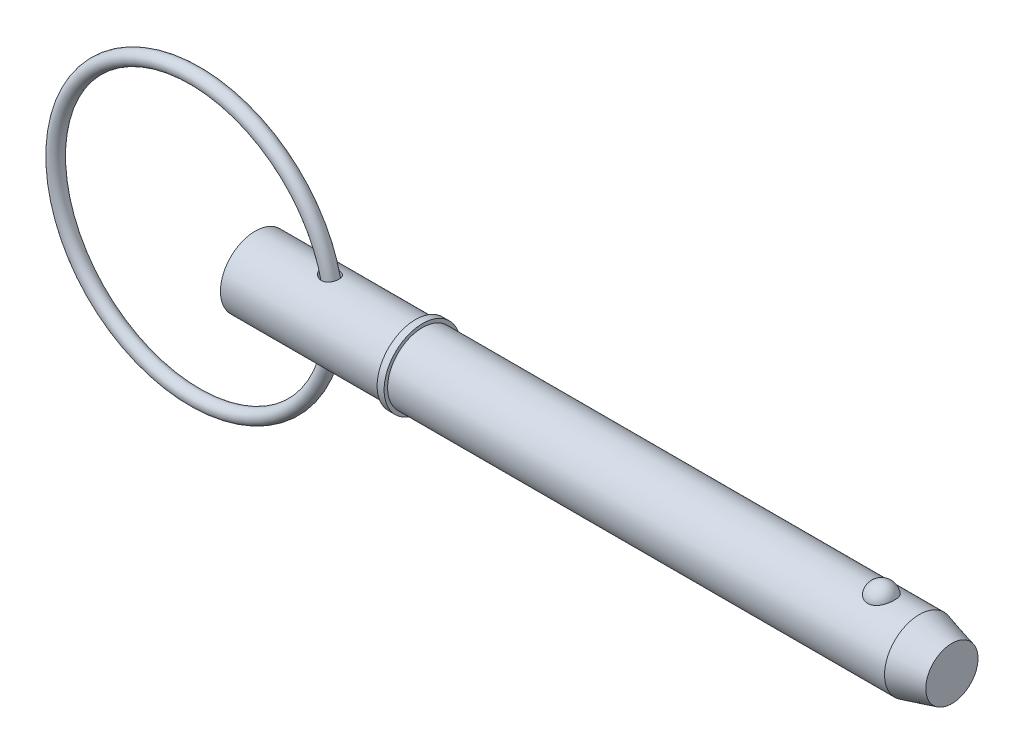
ISO-10303-21;
HEADER;
FILE_DESCRIPTION(('STEP AP214'),'2;1');
FILE_NAME('part.step','',(''),(''),'','','');
FILE_SCHEMA(('AUTOMOTIVE_DESIGN { 1 0 10303 214 1 1 1 1 }'));
ENDSEC;
DATA;
#1=APPLICATION_CONTEXT('core data for automotive mechanical design processes');
#2=APPLICATION_PROTOCOL_DEFINITION('international standard','automotive_design',2000,#1);
#3=PRODUCT_CONTEXT('',#1,'mechanical');
#4=PRODUCT('Part','Part','',(#3));
#5=PRODUCT_RELATED_PRODUCT_CATEGORY('part','',(#4));
#6=PRODUCT_DEFINITION_FORMATION('','',#4);
#7=PRODUCT_DEFINITION_CONTEXT('part definition',#1,'design');
#8=PRODUCT_DEFINITION('design','',#6,#7);
#9=PRODUCT_DEFINITION_SHAPE('','',#8);
#10=(LENGTH_UNIT() NAMED_UNIT(*) SI_UNIT(.MILLI.,.METRE.));
#11=(NAMED_UNIT(*) PLANE_ANGLE_UNIT() SI_UNIT($,.RADIAN.));
#12=(NAMED_UNIT(*) SI_UNIT($,.STERADIAN.) SOLID_ANGLE_UNIT());
#13=UNCERTAINTY_MEASURE_WITH_UNIT(LENGTH_MEASURE(1.E-05),#10,'distance_accuracy_value','');
#14=(GEOMETRIC_REPRESENTATION_CONTEXT(3) GLOBAL_UNCERTAINTY_ASSIGNED_CONTEXT((#13)) GLOBAL_UNIT_ASSIGNED_CONTEXT((#10,
#11,#12)) REPRESENTATION_CONTEXT('',''));
#15=CARTESIAN_POINT('',(0.,0.,0.));
#16=DIRECTION('',(0.,0.,1.));
#17=DIRECTION('',(1.,0.,0.));
#18=AXIS2_PLACEMENT_3D('',#15,#16,#17);
#19=CARTESIAN_POINT('',(-6.86864682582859,0.,0.));
#20=DIRECTION('',(0.,0.,1.));
#21=DIRECTION('',(1.,0.,0.));
#22=AXIS2_PLACEMENT_3D('',#19,#20,#21);
#23=TOROIDAL_SURFACE('',#22,15.875,0.794);
#24=CARTESIAN_POINT('',(9.80035317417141,0.,0.));
#25=VERTEX_POINT('',#24);
#26=VERTEX_LOOP('',#25);
#27=FACE_BOUND('',#26,.T.);
#28=ADVANCED_FACE('P0_F12',(#27),#23,.T.);
#29=CLOSED_SHELL('',(#28));
#30=MANIFOLD_SOLID_BREP('P0_B1',#29);
#31=CARTESIAN_POINT('',(0.,0.,0.));
#32=DIRECTION('',(1.,0.,0.));
#33=DIRECTION('',(0.,0.,-1.));
#34=AXIS2_PLACEMENT_3D('',#31,#32,#33);
#35=CYLINDRICAL_SURFACE('',#34,3.97);
#36=CARTESIAN_POINT('',(7.55504033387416,3.95240335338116,-0.373373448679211));
#37=CARTESIAN_POINT('',(7.57857626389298,3.94742764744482,-0.426034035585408));
#38=CARTESIAN_POINT('',(7.60690043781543,3.94158882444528,-0.476521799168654));
#39=CARTESIAN_POINT('',(7.67175252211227,3.92889627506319,-0.571840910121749));
#40=CARTESIAN_POINT('',(7.70829717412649,3.92204048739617,-0.616660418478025));
#41=CARTESIAN_POINT('',(7.7880127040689,3.90811378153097,-0.699502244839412));
#42=CARTESIAN_POINT('',(7.83115323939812,3.90104396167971,-0.737554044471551));
#43=CARTESIAN_POINT('',(7.92290500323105,3.88739302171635,-0.806417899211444));
#44=CARTESIAN_POINT('',(7.97151503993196,3.88081179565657,-0.837231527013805));
#45=CARTESIAN_POINT('',(8.07649084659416,3.86840671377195,-0.89285990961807));
#46=CARTESIAN_POINT('',(8.13315921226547,3.86266475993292,-0.917124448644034));
#47=CARTESIAN_POINT('',(8.249903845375,3.85323449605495,-0.95597423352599));
#48=CARTESIAN_POINT('',(8.30998046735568,3.84954640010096,-0.970558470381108));
#49=CARTESIAN_POINT('',(8.43159099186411,3.84477321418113,-0.989300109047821));
#50=CARTESIAN_POINT('',(8.49311729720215,3.84367671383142,-0.993503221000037));
#51=CARTESIAN_POINT('',(8.61594280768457,3.84429915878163,-0.991094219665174));
#52=CARTESIAN_POINT('',(8.67724211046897,3.84601670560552,-0.984487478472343));
#53=CARTESIAN_POINT('',(8.79355089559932,3.85191689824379,-0.961127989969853));
#54=CARTESIAN_POINT('',(8.84870898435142,3.85593011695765,-0.945070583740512));
#55=CARTESIAN_POINT('',(8.95525145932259,3.86583609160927,-0.903692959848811));
#56=CARTESIAN_POINT('',(9.00663668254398,3.87172842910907,-0.878374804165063));
#57=CARTESIAN_POINT('',(9.101933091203,3.88440641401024,-0.820440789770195));
#58=CARTESIAN_POINT('',(9.14607052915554,3.89114280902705,-0.788185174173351));
#59=CARTESIAN_POINT('',(9.22823149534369,3.90493885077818,-0.71671042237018));
#60=CARTESIAN_POINT('',(9.26625504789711,3.91199849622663,-0.677491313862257));
#61=CARTESIAN_POINT('',(9.33526828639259,3.92567450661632,-0.59313132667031));
#62=CARTESIAN_POINT('',(9.36624800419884,3.93229023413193,-0.547982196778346));
#63=CARTESIAN_POINT('',(9.42036305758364,3.94435299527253,-0.453062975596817));
#64=CARTESIAN_POINT('',(9.44349799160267,3.94979996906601,-0.403292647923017));
#65=CARTESIAN_POINT('',(9.48161154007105,3.95900091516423,-0.299892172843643));
#66=CARTESIAN_POINT('',(9.49648966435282,3.96273393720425,-0.246223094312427));
#67=CARTESIAN_POINT('',(9.51731386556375,3.96800895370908,-0.137074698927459));
#68=CARTESIAN_POINT('',(9.52325977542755,3.9695509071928,-0.0815953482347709));
#69=CARTESIAN_POINT('',(9.52608552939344,3.97028010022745,0.0297918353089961));
#70=CARTESIAN_POINT('',(9.52293563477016,3.96945961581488,0.0857004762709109));
#71=CARTESIAN_POINT('',(9.5075790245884,3.96553529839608,0.196178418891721));
#72=CARTESIAN_POINT('',(9.49537214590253,3.96243142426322,0.25074769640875));
#73=CARTESIAN_POINT('',(9.46218733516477,3.95427513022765,0.357000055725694));
#74=CARTESIAN_POINT('',(9.44120904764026,3.94922263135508,0.40868302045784));
#75=CARTESIAN_POINT('',(9.39097869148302,3.93771960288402,0.507691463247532));
#76=CARTESIAN_POINT('',(9.36172655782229,3.93126906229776,0.555016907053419));
#77=CARTESIAN_POINT('',(9.29572260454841,3.9176964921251,0.643874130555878));
#78=CARTESIAN_POINT('',(9.25898413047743,3.91057566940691,0.685416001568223));
#79=CARTESIAN_POINT('',(9.1789232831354,3.89645576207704,0.761601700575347));
#80=CARTESIAN_POINT('',(9.13560164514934,3.88945666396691,0.79624629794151));
#81=CARTESIAN_POINT('',(9.04406003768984,3.87645097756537,0.857319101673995));
#82=CARTESIAN_POINT('',(8.99589768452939,3.87043453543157,0.883831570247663));
#83=CARTESIAN_POINT('',(8.89567287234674,3.85997577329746,0.928447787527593));
#84=CARTESIAN_POINT('',(8.84361081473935,3.85553329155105,0.946552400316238));
#85=CARTESIAN_POINT('',(8.73746664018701,3.84871527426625,0.973904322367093));
#86=CARTESIAN_POINT('',(8.68340054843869,3.84632597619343,0.983210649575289));
#87=CARTESIAN_POINT('',(8.57443237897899,3.84376823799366,0.993162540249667));
#88=CARTESIAN_POINT('',(8.51953018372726,3.84360011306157,0.993806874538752));
#89=CARTESIAN_POINT('',(8.40868901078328,3.84546046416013,0.986583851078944));
#90=CARTESIAN_POINT('',(8.35276804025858,3.84755469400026,0.97846170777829));
#91=CARTESIAN_POINT('',(8.24293801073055,3.85374731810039,0.953777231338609));
#92=CARTESIAN_POINT('',(8.18902962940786,3.85784638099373,0.937212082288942));
#93=CARTESIAN_POINT('',(8.08103474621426,3.86789936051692,0.894850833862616));
#94=CARTESIAN_POINT('',(8.02716623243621,3.87395687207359,0.868522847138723));
#95=CARTESIAN_POINT('',(7.92444974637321,3.88711632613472,0.807586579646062));
#96=CARTESIAN_POINT('',(7.87560399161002,3.89421872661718,0.7729746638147));
#97=CARTESIAN_POINT('',(7.7825771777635,3.90895350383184,0.694712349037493));
#98=CARTESIAN_POINT('',(7.73864194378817,3.916595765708,0.650769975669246));
#99=CARTESIAN_POINT('',(7.65930793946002,3.93121788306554,0.555638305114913));
#100=CARTESIAN_POINT('',(7.62390591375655,3.93819799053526,0.504451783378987));
#101=CARTESIAN_POINT('',(7.56512704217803,3.95020492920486,0.399268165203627));
#102=CARTESIAN_POINT('',(7.54117152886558,3.95532161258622,0.345606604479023));
#103=CARTESIAN_POINT('',(7.5037545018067,3.96345177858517,0.234589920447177));
#104=CARTESIAN_POINT('',(7.49028363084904,3.96646713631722,0.177238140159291));
#105=CARTESIAN_POINT('',(7.4756155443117,3.96976030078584,0.0675802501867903));
#106=CARTESIAN_POINT('',(7.47319553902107,3.97031070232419,0.0154431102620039));
#107=CARTESIAN_POINT('',(7.47743162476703,3.96935406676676,-0.0884045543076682));
#108=CARTESIAN_POINT('',(7.48407724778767,3.96784940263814,-0.14011550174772));
#109=CARTESIAN_POINT('',(7.50184406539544,3.96390208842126,-0.222210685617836));
#110=CARTESIAN_POINT('',(7.51030342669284,3.96203347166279,-0.253229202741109));
#111=CARTESIAN_POINT('',(7.53036279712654,3.95766645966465,-0.314179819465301));
#112=CARTESIAN_POINT('',(7.5419623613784,3.9551681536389,-0.344112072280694));
#113=CARTESIAN_POINT('',(7.55504033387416,3.95240335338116,-0.373373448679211));
#114=B_SPLINE_CURVE_WITH_KNOTS('',3,(#36,#37,#38,#39,#40,#41,#42,#43,#44,#45,#46,#47,#48,#49,
#50,#51,#52,#53,#54,#55,#56,#57,#58,#59,#60,#61,#62,#63,#64,#65,#66,#67,#68,#69,#70,#71,#72,#73,
#74,#75,#76,#77,#78,#79,#80,#81,#82,#83,#84,#85,#86,#87,#88,#89,#90,#91,#92,#93,#94,#95,#96,#97,
#98,#99,#100,#101,#102,#103,#104,#105,#106,#107,#108,#109,#110,#111,#112,#113),.UNSPECIFIED.,
.T.,.F.,(4,2,2,2,2,2,2,2,2,2,2,2,2,2,2,2,2,2,2,2,2,2,2,2,2,2,2,2,2,2,2,2,2,2,2,2,2,2,4),(0.,
0.173554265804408,0.347465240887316,0.520599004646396,0.693695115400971,0.878558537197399,
1.0634412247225,1.24750837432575,1.43148407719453,1.60336872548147,1.77521512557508,
1.93967886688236,2.10414195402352,2.26883635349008,2.43353918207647,2.60020488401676,
2.76687370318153,2.93408806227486,3.10130543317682,3.26852958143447,3.43575504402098,
3.60268496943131,3.76959626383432,3.93471461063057,4.0998159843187,4.26380184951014,
4.42781098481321,4.5967184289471,4.76568224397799,4.94567321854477,5.12574332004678,
5.31261375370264,5.49941278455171,5.67537040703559,5.85117081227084,6.00695555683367,
6.16256057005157,6.25901137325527,6.35544851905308),.UNSPECIFIED.);
#115=CARTESIAN_POINT('',(7.55504033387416,3.95240335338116,-0.373373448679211));
#116=VERTEX_POINT('',#115);
#117=EDGE_CURVE('P1_E42',#116,#116,#114,.T.);
#118=ORIENTED_EDGE('',*,*,#117,.T.);
#119=EDGE_LOOP('',(#118));
#120=FACE_BOUND('',#119,.T.);
#121=CARTESIAN_POINT('',(0.,0.,0.));
#122=DIRECTION('',(1.,0.,0.));
#123=DIRECTION('',(0.,0.,-1.));
#124=AXIS2_PLACEMENT_3D('',#121,#122,#123);
#125=CIRCLE('',#124,3.97);
#126=CARTESIAN_POINT('',(0.,0.,-3.97));
#127=VERTEX_POINT('',#126);
#128=EDGE_CURVE('P1_E9',#127,#127,#125,.T.);
#129=ORIENTED_EDGE('',*,*,#128,.T.);
#130=EDGE_LOOP('',(#129));
#131=FACE_BOUND('',#130,.T.);
#132=CARTESIAN_POINT('',(18.256,0.,0.));
#133=DIRECTION('',(1.,0.,0.));
#134=DIRECTION('',(0.,0.,-1.));
#135=AXIS2_PLACEMENT_3D('',#132,#133,#134);
#136=CIRCLE('',#135,3.97);
#137=CARTESIAN_POINT('',(18.256,0.,-3.97));
#138=VERTEX_POINT('',#137);
#139=EDGE_CURVE('P1_E25',#138,#138,#136,.T.);
#140=ORIENTED_EDGE('',*,*,#139,.F.);
#141=EDGE_LOOP('',(#140));
#142=FACE_BOUND('',#141,.T.);
#143=CARTESIAN_POINT('',(7.55504033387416,-3.95240335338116,-0.373373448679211));
#144=CARTESIAN_POINT('',(7.53460920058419,-3.95672239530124,-0.327655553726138));
#145=CARTESIAN_POINT('',(7.51777420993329,-3.96039298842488,-0.280271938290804));
#146=CARTESIAN_POINT('',(7.49205527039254,-3.96606288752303,-0.183298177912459));
#147=CARTESIAN_POINT('',(7.48316724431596,-3.96806305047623,-0.133709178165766));
#148=CARTESIAN_POINT('',(7.47379315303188,-3.9701737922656,-0.0336103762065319));
#149=CARTESIAN_POINT('',(7.47332172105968,-3.97028108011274,0.0169008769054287));
#150=CARTESIAN_POINT('',(7.48084392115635,-3.96858544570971,0.11725681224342));
#151=CARTESIAN_POINT('',(7.48883849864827,-3.96678231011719,0.167101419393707));
#152=CARTESIAN_POINT('',(7.51265320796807,-3.96151492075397,0.263832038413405));
#153=CARTESIAN_POINT('',(7.52833209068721,-3.95808068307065,0.310754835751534));
#154=CARTESIAN_POINT('',(7.56673745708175,-3.94990960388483,0.401487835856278));
#155=CARTESIAN_POINT('',(7.58946563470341,-3.94517244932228,0.44529728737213));
#156=CARTESIAN_POINT('',(7.64284475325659,-3.93448395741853,0.53175081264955));
#157=CARTESIAN_POINT('',(7.67392233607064,-3.92847279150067,0.57412324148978));
#158=CARTESIAN_POINT('',(7.74208866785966,-3.91602761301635,0.653644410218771));
#159=CARTESIAN_POINT('',(7.77918016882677,-3.90959340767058,0.690790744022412));
#160=CARTESIAN_POINT('',(7.86273878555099,-3.89617013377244,0.763056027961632));
#161=CARTESIAN_POINT('',(7.90978795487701,-3.88919756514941,0.797506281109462));
#162=CARTESIAN_POINT('',(8.00882206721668,-3.87616232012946,0.858629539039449));
#163=CARTESIAN_POINT('',(8.06080923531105,-3.87010005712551,0.885299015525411));
#164=CARTESIAN_POINT('',(8.17187138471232,-3.85921766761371,0.931635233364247));
#165=CARTESIAN_POINT('',(8.23118658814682,-3.85449995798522,0.950754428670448));
#166=CARTESIAN_POINT('',(8.35233947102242,-3.84749758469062,0.97871022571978));
#167=CARTESIAN_POINT('',(8.41417663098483,-3.84521242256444,0.987548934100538));
#168=CARTESIAN_POINT('',(8.53665727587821,-3.84349493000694,0.994212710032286));
#169=CARTESIAN_POINT('',(8.59728174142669,-3.84397996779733,0.99235677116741));
#170=CARTESIAN_POINT('',(8.71718393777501,-3.84764343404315,0.978056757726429));
#171=CARTESIAN_POINT('',(8.77646227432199,-3.8508206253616,0.965617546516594));
#172=CARTESIAN_POINT('',(8.88778602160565,-3.85921632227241,0.931467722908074));
#173=CARTESIAN_POINT('',(8.94005016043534,-3.864284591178,0.91043061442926));
#174=CARTESIAN_POINT('',(9.04004360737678,-3.87587542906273,0.85974532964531));
#175=CARTESIAN_POINT('',(9.08777352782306,-3.88239780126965,0.830098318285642));
#176=CARTESIAN_POINT('',(9.17600506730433,-3.895934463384,0.763999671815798));
#177=CARTESIAN_POINT('',(9.21667512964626,-3.90292920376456,0.727768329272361));
#178=CARTESIAN_POINT('',(9.29136502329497,-3.91679963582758,0.648981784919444));
#179=CARTESIAN_POINT('',(9.32538470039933,-3.92367532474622,0.606426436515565));
#180=CARTESIAN_POINT('',(9.38618865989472,-3.9366168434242,0.515806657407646));
#181=CARTESIAN_POINT('',(9.4129117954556,-3.9426756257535,0.467700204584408));
#182=CARTESIAN_POINT('',(9.45812227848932,-3.95326415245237,0.367605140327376));
#183=CARTESIAN_POINT('',(9.47660924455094,-3.95779382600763,0.315616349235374));
#184=CARTESIAN_POINT('',(9.50505994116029,-3.96487773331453,0.208669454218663));
#185=CARTESIAN_POINT('',(9.51493710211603,-3.96741187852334,0.153686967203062));
#186=CARTESIAN_POINT('',(9.52562221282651,-3.97015680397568,0.0427905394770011));
#187=CARTESIAN_POINT('',(9.52643004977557,-3.97036755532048,-0.0131234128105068));
#188=CARTESIAN_POINT('',(9.51895215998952,-3.96844170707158,-0.124381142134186));
#189=CARTESIAN_POINT('',(9.51065320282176,-3.96630169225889,-0.179723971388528));
#190=CARTESIAN_POINT('',(9.48513477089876,-3.95989913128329,-0.288186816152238));
#191=CARTESIAN_POINT('',(9.46791509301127,-3.95563653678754,-0.341306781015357));
#192=CARTESIAN_POINT('',(9.42495956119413,-3.94545061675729,-0.443818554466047));
#193=CARTESIAN_POINT('',(9.39922309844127,-3.93952717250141,-0.493210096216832));
#194=CARTESIAN_POINT('',(9.33985370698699,-3.92667071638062,-0.586850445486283));
#195=CARTESIAN_POINT('',(9.30622091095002,-3.91973772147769,-0.631099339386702));
#196=CARTESIAN_POINT('',(9.23204774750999,-3.9056660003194,-0.713019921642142));
#197=CARTESIAN_POINT('',(9.19153441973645,-3.89852816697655,-0.750716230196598));
#198=CARTESIAN_POINT('',(9.10459278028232,-3.88483152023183,-0.818650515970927));
#199=CARTESIAN_POINT('',(9.05816529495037,-3.87827262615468,-0.848889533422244));
#200=CARTESIAN_POINT('',(8.96131655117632,-3.86655481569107,-0.900752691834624));
#201=CARTESIAN_POINT('',(8.91095192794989,-3.86137955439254,-0.922478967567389));
#202=CARTESIAN_POINT('',(8.8071927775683,-3.85288425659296,-0.957343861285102));
#203=CARTESIAN_POINT('',(8.75379837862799,-3.84956414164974,-0.97048284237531));
#204=CARTESIAN_POINT('',(8.64548182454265,-3.84510108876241,-0.988018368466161));
#205=CARTESIAN_POINT('',(8.59055875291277,-3.84395948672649,-0.992409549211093));
#206=CARTESIAN_POINT('',(8.48070473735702,-3.84391315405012,-0.992587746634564));
#207=CARTESIAN_POINT('',(8.42577379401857,-3.84500886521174,-0.988373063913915));
#208=CARTESIAN_POINT('',(8.31494327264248,-3.84934404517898,-0.971354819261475));
#209=CARTESIAN_POINT('',(8.25910274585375,-3.85267319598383,-0.958191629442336));
#210=CARTESIAN_POINT('',(8.15023512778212,-3.86114252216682,-0.923469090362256));
#211=CARTESIAN_POINT('',(8.09720922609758,-3.86628345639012,-0.901906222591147));
#212=CARTESIAN_POINT('',(7.9918189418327,-3.87819313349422,-0.849289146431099));
#213=CARTESIAN_POINT('',(7.93972943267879,-3.88504694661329,-0.817702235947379));
#214=CARTESIAN_POINT('',(7.84154327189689,-3.89937910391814,-0.746366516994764));
#215=CARTESIAN_POINT('',(7.79544783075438,-3.90685757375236,-0.706616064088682));
#216=CARTESIAN_POINT('',(7.71208259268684,-3.92134227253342,-0.621122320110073));
#217=CARTESIAN_POINT('',(7.67457985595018,-3.92835595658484,-0.57560820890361));
#218=CARTESIAN_POINT('',(7.60807883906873,-3.94134589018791,-0.478617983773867));
#219=CARTESIAN_POINT('',(7.57907194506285,-3.94732318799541,-0.427147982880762));
#220=CARTESIAN_POINT('',(7.55504033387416,-3.95240335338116,-0.373373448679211));
#221=B_SPLINE_CURVE_WITH_KNOTS('',3,(#143,#144,#145,#146,#147,#148,#149,#150,#151,#152,#153,
#154,#155,#156,#157,#158,#159,#160,#161,#162,#163,#164,#165,#166,#167,#168,#169,#170,#171,#172,
#173,#174,#175,#176,#177,#178,#179,#180,#181,#182,#183,#184,#185,#186,#187,#188,#189,#190,#191,
#192,#193,#194,#195,#196,#197,#198,#199,#200,#201,#202,#203,#204,#205,#206,#207,#208,#209,#210,
#211,#212,#213,#214,#215,#216,#217,#218,#219,#220),.UNSPECIFIED.,.T.,.F.,(4,2,2,2,2,2,2,2,2,2,2,
2,2,2,2,2,2,2,2,2,2,2,2,2,2,2,2,2,2,2,2,2,2,2,2,2,2,2,4),(0.,0.150601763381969,
0.301126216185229,0.451912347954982,0.602715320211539,0.750844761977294,0.899009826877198,
1.05703657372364,1.21513583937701,1.39056726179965,1.56607811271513,1.75265499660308,
1.93919364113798,2.12019769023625,2.30111860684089,2.46997605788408,2.63881067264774,
2.80278822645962,2.96676958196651,3.13208567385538,3.29740942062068,3.46437689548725,
3.63134644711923,3.79855889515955,3.96577515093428,4.13300336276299,4.30022876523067,
4.46681158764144,4.63337115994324,4.79786624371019,4.96235437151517,5.12694333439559,
5.29156480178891,5.46322695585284,5.63496109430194,5.81803489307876,6.00114560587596,
6.1784675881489,6.35560915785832),.UNSPECIFIED.);
#222=CARTESIAN_POINT('',(7.55504033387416,-3.95240335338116,-0.373373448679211));
#223=VERTEX_POINT('',#222);
#224=EDGE_CURVE('P1_E17',#223,#223,#221,.T.);
#225=ORIENTED_EDGE('',*,*,#224,.T.);
#226=EDGE_LOOP('',(#225));
#227=FACE_BOUND('',#226,.T.);
#228=ADVANCED_FACE('P1_F13',(#120,#131,#142,#227),#35,.T.);
#229=CARTESIAN_POINT('',(0.,0.,0.));
#230=DIRECTION('',(1.,0.,0.));
#231=DIRECTION('',(0.,0.,-1.));
#232=AXIS2_PLACEMENT_3D('',#229,#230,#231);
#233=CYLINDRICAL_SURFACE('',#232,3.97);
#234=CARTESIAN_POINT('',(75.6759395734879,0.,0.));
#235=DIRECTION('',(1.,0.,0.));
#236=DIRECTION('',(0.,0.,-1.));
#237=AXIS2_PLACEMENT_3D('',#234,#235,#236);
#238=CIRCLE('',#237,3.97);
#239=CARTESIAN_POINT('',(75.6759395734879,0.,-3.97));
#240=VERTEX_POINT('',#239);
#241=EDGE_CURVE('P1_E99',#240,#240,#238,.T.);
#242=ORIENTED_EDGE('',*,*,#241,.F.);
#243=EDGE_LOOP('',(#242));
#244=FACE_BOUND('',#243,.T.);
#245=CARTESIAN_POINT('',(19.05,0.,0.));
#246=DIRECTION('',(1.,0.,0.));
#247=DIRECTION('',(0.,0.,-1.));
#248=AXIS2_PLACEMENT_3D('',#245,#246,#247);
#249=CIRCLE('',#248,3.97);
#250=CARTESIAN_POINT('',(19.05,0.,-3.97));
#251=VERTEX_POINT('',#250);
#252=EDGE_CURVE('P1_E96',#251,#251,#249,.T.);
#253=ORIENTED_EDGE('',*,*,#252,.T.);
#254=EDGE_LOOP('',(#253));
#255=FACE_BOUND('',#254,.T.);
#256=CARTESIAN_POINT('',(71.3451922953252,3.65715365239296,1.54470941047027));
#257=CARTESIAN_POINT('',(71.2652448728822,3.65716001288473,1.54470290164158));
#258=CARTESIAN_POINT('',(71.1851650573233,3.65987074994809,1.53832549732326));
#259=CARTESIAN_POINT('',(71.0272374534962,3.67042218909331,1.5129701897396));
#260=CARTESIAN_POINT('',(70.9493961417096,3.67827646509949,1.49395894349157));
#261=CARTESIAN_POINT('',(70.7984614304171,3.69818848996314,1.44395950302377));
#262=CARTESIAN_POINT('',(70.7253560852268,3.71023513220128,1.41300293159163));
#263=CARTESIAN_POINT('',(70.5855630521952,3.73721833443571,1.34000212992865));
#264=CARTESIAN_POINT('',(70.5188725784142,3.75215363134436,1.2979627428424));
#265=CARTESIAN_POINT('',(70.3914886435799,3.78384968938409,1.20248834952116));
#266=CARTESIAN_POINT('',(70.3310299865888,3.80065129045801,1.14875388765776));
#267=CARTESIAN_POINT('',(70.2196942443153,3.83398532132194,1.03205417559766));
#268=CARTESIAN_POINT('',(70.1688200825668,3.85051766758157,0.969086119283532));
#269=CARTESIAN_POINT('',(70.0756321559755,3.88238608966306,0.832526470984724));
#270=CARTESIAN_POINT('',(70.0337961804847,3.89763698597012,0.758588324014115));
#271=CARTESIAN_POINT('',(69.9625108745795,3.92451063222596,0.604352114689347));
#272=CARTESIAN_POINT('',(69.9330623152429,3.93613315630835,0.524053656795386));
#273=CARTESIAN_POINT('',(69.8868927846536,3.95467606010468,0.358403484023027));
#274=CARTESIAN_POINT('',(69.8703127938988,3.96154426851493,0.273006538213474));
#275=CARTESIAN_POINT('',(69.850756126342,3.96967008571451,0.100408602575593));
#276=CARTESIAN_POINT('',(69.8477789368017,3.97092790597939,0.0132076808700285));
#277=CARTESIAN_POINT('',(69.8554587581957,3.96771794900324,-0.159844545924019));
#278=CARTESIAN_POINT('',(69.8660164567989,3.96329187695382,-0.245701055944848));
#279=CARTESIAN_POINT('',(69.9003800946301,3.94923163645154,-0.414277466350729));
#280=CARTESIAN_POINT('',(69.9241862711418,3.9395973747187,-0.496997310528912));
#281=CARTESIAN_POINT('',(69.9846114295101,3.91607752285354,-0.657113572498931));
#282=CARTESIAN_POINT('',(70.0212495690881,3.90218558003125,-0.734501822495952));
#283=CARTESIAN_POINT('',(70.1065935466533,3.87158287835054,-0.881704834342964));
#284=CARTESIAN_POINT('',(70.1553004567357,3.8548718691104,-0.951518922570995));
#285=CARTESIAN_POINT('',(70.2641161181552,3.82028735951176,-1.08208159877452));
#286=CARTESIAN_POINT('',(70.3242955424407,3.80240713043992,-1.14276958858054));
#287=CARTESIAN_POINT('',(70.454493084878,3.76758161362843,-1.25282437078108));
#288=CARTESIAN_POINT('',(70.5245105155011,3.75063626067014,-1.30219195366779));
#289=CARTESIAN_POINT('',(70.67118160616,3.71998948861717,-1.38729709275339));
#290=CARTESIAN_POINT('',(70.7476813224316,3.70623183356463,-1.42327904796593));
#291=CARTESIAN_POINT('',(70.9062981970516,3.68323188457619,-1.48178996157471));
#292=CARTESIAN_POINT('',(70.9884132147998,3.67398788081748,-1.50432401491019));
#293=CARTESIAN_POINT('',(71.151481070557,3.66152163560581,-1.53440939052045));
#294=CARTESIAN_POINT('',(71.2322840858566,3.65801951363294,-1.54265826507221));
#295=CARTESIAN_POINT('',(71.3942085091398,3.65657341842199,-1.54608423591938));
#296=CARTESIAN_POINT('',(71.4753298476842,3.65862829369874,-1.54126404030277));
#297=CARTESIAN_POINT('',(71.6328122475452,3.66788969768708,-1.51908474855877));
#298=CARTESIAN_POINT('',(71.7092422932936,3.67492621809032,-1.50213925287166));
#299=CARTESIAN_POINT('',(71.8580412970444,3.6931840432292,-1.45666982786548));
#300=CARTESIAN_POINT('',(71.9304099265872,3.70440568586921,-1.42814496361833));
#301=CARTESIAN_POINT('',(72.0708029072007,3.73012749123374,-1.35956319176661));
#302=CARTESIAN_POINT('',(72.1387000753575,3.74469307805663,-1.31927107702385));
#303=CARTESIAN_POINT('',(72.2668649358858,3.77545272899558,-1.22847440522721));
#304=CARTESIAN_POINT('',(72.3271308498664,3.79164717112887,-1.17796747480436));
#305=CARTESIAN_POINT('',(72.4416346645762,3.82490325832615,-1.06519260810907));
#306=CARTESIAN_POINT('',(72.4954137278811,3.84196735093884,-1.00245914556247));
#307=CARTESIAN_POINT('',(72.5920988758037,3.87439863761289,-0.868715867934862));
#308=CARTESIAN_POINT('',(72.6350030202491,3.88976552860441,-0.797704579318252));
#309=CARTESIAN_POINT('',(72.710266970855,3.91771381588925,-0.646896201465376));
#310=CARTESIAN_POINT('',(72.7422532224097,3.93019255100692,-0.566893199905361));
#311=CARTESIAN_POINT('',(72.7931101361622,3.95043886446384,-0.402255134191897));
#312=CARTESIAN_POINT('',(72.811980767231,3.95820643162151,-0.31762005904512));
#313=CARTESIAN_POINT('',(72.8362162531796,3.96823733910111,-0.146156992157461));
#314=CARTESIAN_POINT('',(72.8415874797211,3.970503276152,-0.0593300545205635));
#315=CARTESIAN_POINT('',(72.8387309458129,3.96930811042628,0.11405797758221));
#316=CARTESIAN_POINT('',(72.830503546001,3.9658471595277,0.200619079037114));
#317=CARTESIAN_POINT('',(72.8007063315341,3.95358562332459,0.370506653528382));
#318=CARTESIAN_POINT('',(72.7792129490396,3.94481563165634,0.453848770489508));
#319=CARTESIAN_POINT('',(72.7233839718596,3.92284586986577,0.615497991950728));
#320=CARTESIAN_POINT('',(72.6890474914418,3.90964579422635,0.693804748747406));
#321=CARTESIAN_POINT('',(72.6079702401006,3.88006987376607,0.843703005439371));
#322=CARTESIAN_POINT('',(72.5611536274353,3.86367478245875,0.915249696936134));
#323=CARTESIAN_POINT('',(72.4561897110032,3.82949741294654,1.0491081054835));
#324=CARTESIAN_POINT('',(72.3980428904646,3.81171519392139,1.11142021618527));
#325=CARTESIAN_POINT('',(72.2717433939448,3.77673366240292,1.22503948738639));
#326=CARTESIAN_POINT('',(72.2035970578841,3.75953398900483,1.27635357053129));
#327=CARTESIAN_POINT('',(72.0589009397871,3.7277050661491,1.36653336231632));
#328=CARTESIAN_POINT('',(71.9823480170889,3.71307678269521,1.40539439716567));
#329=CARTESIAN_POINT('',(71.8257594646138,3.68864287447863,1.46830480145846));
#330=CARTESIAN_POINT('',(71.7459307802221,3.67869017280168,1.4928128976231));
#331=CARTESIAN_POINT('',(71.5829877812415,3.66414535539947,1.52817474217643));
#332=CARTESIAN_POINT('',(71.4998840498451,3.65953723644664,1.5390692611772));
#333=CARTESIAN_POINT('',(71.3927760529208,3.65738948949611,1.54414878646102));
#334=CARTESIAN_POINT('',(71.3689900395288,3.65715175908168,1.54471134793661));
#335=CARTESIAN_POINT('',(71.3451922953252,3.65715365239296,1.54470941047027));
#336=B_SPLINE_CURVE_WITH_KNOTS('',3,(#256,#257,#258,#259,#260,#261,#262,#263,#264,#265,#266,
#267,#268,#269,#270,#271,#272,#273,#274,#275,#276,#277,#278,#279,#280,#281,#282,#283,#284,#285,
#286,#287,#288,#289,#290,#291,#292,#293,#294,#295,#296,#297,#298,#299,#300,#301,#302,#303,#304,
#305,#306,#307,#308,#309,#310,#311,#312,#313,#314,#315,#316,#317,#318,#319,#320,#321,#322,#323,
#324,#325,#326,#327,#328,#329,#330,#331,#332,#333,#334,#335),.UNSPECIFIED.,.T.,.F.,(4,2,2,2,2,2,
2,2,2,2,2,2,2,2,2,2,2,2,2,2,2,2,2,2,2,2,2,2,2,2,2,2,2,2,2,2,2,2,2,4),(0.,0.239777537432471,
0.480190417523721,0.719971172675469,0.959647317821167,1.2063904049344,1.45320863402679,
1.71093679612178,1.96868099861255,2.22921052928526,2.48973023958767,2.7483492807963,
3.00697295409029,3.26598440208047,3.52501886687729,3.78570385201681,4.04637062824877,
4.30201257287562,4.55755760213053,4.80022994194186,5.04285200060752,5.27757006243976,
5.51230707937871,5.75210128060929,5.99195126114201,6.24392810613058,6.49594987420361,
6.75588818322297,7.01582710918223,7.27564332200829,7.53545264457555,7.7937788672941,
8.05212290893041,8.31207418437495,8.57201437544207,8.83179046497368,9.09166393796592,
9.34270057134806,9.59298357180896,9.66435753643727),.UNSPECIFIED.);
#337=CARTESIAN_POINT('',(71.3451922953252,3.65715365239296,1.54470941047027));
#338=VERTEX_POINT('',#337);
#339=EDGE_CURVE('P1_E34',#338,#338,#336,.T.);
#340=ORIENTED_EDGE('',*,*,#339,.T.);
#341=EDGE_LOOP('',(#340));
#342=FACE_BOUND('',#341,.T.);
#343=ADVANCED_FACE('P1_F46',(#244,#255,#342),#233,.T.);
#344=CARTESIAN_POINT('',(0.,0.,0.));
#345=DIRECTION('',(-1.,0.,0.));
#346=DIRECTION('',(0.,0.,1.));
#347=AXIS2_PLACEMENT_3D('',#344,#345,#346);
#348=PLANE('',#347);
#349=ORIENTED_EDGE('',*,*,#128,.F.);
#350=EDGE_LOOP('',(#349));
#351=FACE_BOUND('',#350,.T.);
#352=ADVANCED_FACE('P1_F15',(#351),#348,.T.);
#353=CARTESIAN_POINT('',(18.256,3.97,0.));
#354=DIRECTION('',(-1.,0.,0.));
#355=DIRECTION('',(0.,0.,1.));
#356=AXIS2_PLACEMENT_3D('',#353,#354,#355);
#357=PLANE('',#356);
#358=ORIENTED_EDGE('',*,*,#139,.T.);
#359=EDGE_LOOP('',(#358));
#360=FACE_BOUND('',#359,.T.);
#361=CARTESIAN_POINT('',(18.256,0.,0.));
#362=DIRECTION('',(1.,0.,0.));
#363=DIRECTION('',(0.,0.,-1.));
#364=AXIS2_PLACEMENT_3D('',#361,#362,#363);
#365=CIRCLE('',#364,4.367);
#366=CARTESIAN_POINT('',(18.256,0.,-4.367));
#367=VERTEX_POINT('',#366);
#368=EDGE_CURVE('P1_E30',#367,#367,#365,.T.);
#369=ORIENTED_EDGE('',*,*,#368,.F.);
#370=EDGE_LOOP('',(#369));
#371=FACE_BOUND('',#370,.T.);
#372=ADVANCED_FACE('P1_F81',(#360,#371),#357,.T.);
#373=CARTESIAN_POINT('',(0.,0.,0.));
#374=DIRECTION('',(1.,0.,0.));
#375=DIRECTION('',(0.,0.,-1.));
#376=AXIS2_PLACEMENT_3D('',#373,#374,#375);
#377=CYLINDRICAL_SURFACE('',#376,4.367);
#378=ORIENTED_EDGE('',*,*,#368,.T.);
#379=EDGE_LOOP('',(#378));
#380=FACE_BOUND('',#379,.T.);
#381=CARTESIAN_POINT('',(19.05,0.,0.));
#382=DIRECTION('',(1.,0.,0.));
#383=DIRECTION('',(0.,0.,-1.));
#384=AXIS2_PLACEMENT_3D('',#381,#382,#383);
#385=CIRCLE('',#384,4.367);
#386=CARTESIAN_POINT('',(19.05,0.,-4.367));
#387=VERTEX_POINT('',#386);
#388=EDGE_CURVE('P1_E95',#387,#387,#385,.T.);
#389=ORIENTED_EDGE('',*,*,#388,.F.);
#390=EDGE_LOOP('',(#389));
#391=FACE_BOUND('',#390,.T.);
#392=ADVANCED_FACE('P1_F68',(#380,#391),#377,.T.);
#393=CARTESIAN_POINT('',(19.05,4.367,0.));
#394=DIRECTION('',(1.,0.,0.));
#395=DIRECTION('',(0.,0.,-1.));
#396=AXIS2_PLACEMENT_3D('',#393,#394,#395);
#397=PLANE('',#396);
#398=ORIENTED_EDGE('',*,*,#388,.T.);
#399=EDGE_LOOP('',(#398));
#400=FACE_BOUND('',#399,.T.);
#401=ORIENTED_EDGE('',*,*,#252,.F.);
#402=EDGE_LOOP('',(#401));
#403=FACE_BOUND('',#402,.T.);
#404=ADVANCED_FACE('P1_F62',(#400,#403),#397,.T.);
#405=CARTESIAN_POINT('',(79.38,0.,0.));
#406=DIRECTION('',(-1.,0.,0.));
#407=DIRECTION('',(0.,0.,1.));
#408=AXIS2_PLACEMENT_3D('',#405,#406,#407);
#409=CONICAL_SURFACE('',#408,2.97750000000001,0.26179938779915);
#410=ORIENTED_EDGE('',*,*,#241,.T.);
#411=EDGE_LOOP('',(#410));
#412=FACE_BOUND('',#411,.T.);
#413=CARTESIAN_POINT('',(79.38,0.,0.));
#414=DIRECTION('',(1.,0.,0.));
#415=DIRECTION('',(0.,0.,-1.));
#416=AXIS2_PLACEMENT_3D('',#413,#414,#415);
#417=CIRCLE('',#416,2.97750000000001);
#418=CARTESIAN_POINT('',(79.38,0.,-2.97750000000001));
#419=VERTEX_POINT('',#418);
#420=EDGE_CURVE('P1_E41',#419,#419,#417,.T.);
#421=ORIENTED_EDGE('',*,*,#420,.F.);
#422=EDGE_LOOP('',(#421));
#423=FACE_BOUND('',#422,.T.);
#424=ADVANCED_FACE('P1_F59',(#412,#423),#409,.T.);
#425=CARTESIAN_POINT('',(79.38,2.97750000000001,0.));
#426=DIRECTION('',(1.,0.,0.));
#427=DIRECTION('',(0.,0.,-1.));
#428=AXIS2_PLACEMENT_3D('',#425,#426,#427);
#429=PLANE('',#428);
#430=ORIENTED_EDGE('',*,*,#420,.T.);
#431=EDGE_LOOP('',(#430));
#432=FACE_BOUND('',#431,.T.);
#433=ADVANCED_FACE('P1_F55',(#432),#429,.T.);
#434=CARTESIAN_POINT('',(71.3451922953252,3.573,0.));
#435=DIRECTION('',(-1.,0.,0.));
#436=DIRECTION('',(0.,1.,0.));
#437=AXIS2_PLACEMENT_3D('',#434,#435,#436);
#438=SPHERICAL_SURFACE('',#437,1.54699999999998);
#439=ORIENTED_EDGE('',*,*,#339,.F.);
#440=EDGE_LOOP('',(#439));
#441=FACE_BOUND('',#440,.T.);
#442=ADVANCED_FACE('P1_F50',(#441),#438,.T.);
#443=CARTESIAN_POINT('',(-6.86864682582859,0.,0.));
#444=DIRECTION('',(0.,0.,1.));
#445=DIRECTION('',(1.,0.,0.));
#446=AXIS2_PLACEMENT_3D('',#443,#444,#445);
#447=TOROIDAL_SURFACE('',#446,15.875,0.9925);
#448=ORIENTED_EDGE('',*,*,#224,.F.);
#449=EDGE_LOOP('',(#448));
#450=FACE_BOUND('',#449,.T.);
#451=ORIENTED_EDGE('',*,*,#117,.F.);
#452=EDGE_LOOP('',(#451));
#453=FACE_BOUND('',#452,.T.);
#454=ADVANCED_FACE('P1_F54',(#450,#453),#447,.F.);
#455=CLOSED_SHELL('',(#228,#343,#352,#372,#392,#404,#424,#433,#442,#454));
#456=MANIFOLD_SOLID_BREP('P1_B1',#455);
#457=ADVANCED_BREP_SHAPE_REPRESENTATION('',(#18,#30,#456),#14);
#458=SHAPE_DEFINITION_REPRESENTATION(#9,#457);
ENDSEC;
END-ISO-10303-21;
